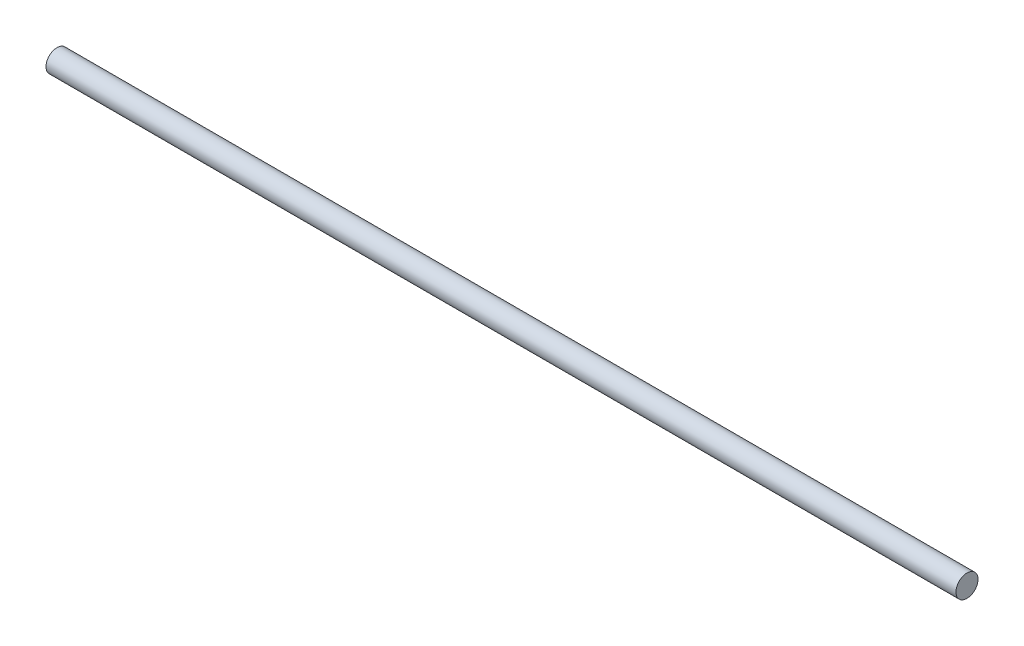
from build123d import *

# Parameters (mm, degrees)
SKETCH1_W = 419.1
SKETCH1_H = 5.08


with BuildPart() as part:
    # Sketch1 → Revolve1 (revolve)
    with BuildSketch(Plane.XY):
        with Locations((-209.55, 2.54)):
            Rectangle(SKETCH1_W, SKETCH1_H)
    revolve(axis=Axis((0, 0, 0), (-1, 0, 0)))


solid = part.part
